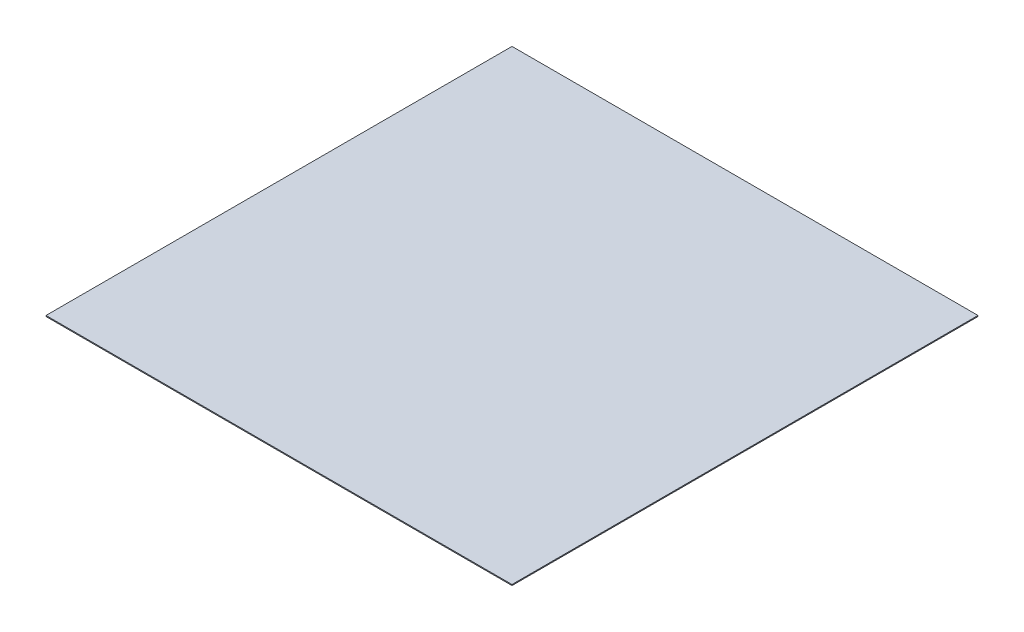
from build123d import *

# Parameters (mm, degrees)
SKETCH1_W               = 609.6
SKETCH1_H               = 1.27
BASE_EXTRUDE_THIN_DEPTH = 304.8


with BuildPart() as part:
    # Sketch1 → Base-Extrude-Thin (new, symmetric)
    with BuildSketch(Plane.XY):
        with Locations((0, -0.635)):
            Rectangle(SKETCH1_W, SKETCH1_H)
    extrude(amount=BASE_EXTRUDE_THIN_DEPTH, both=True)


solid = part.part
